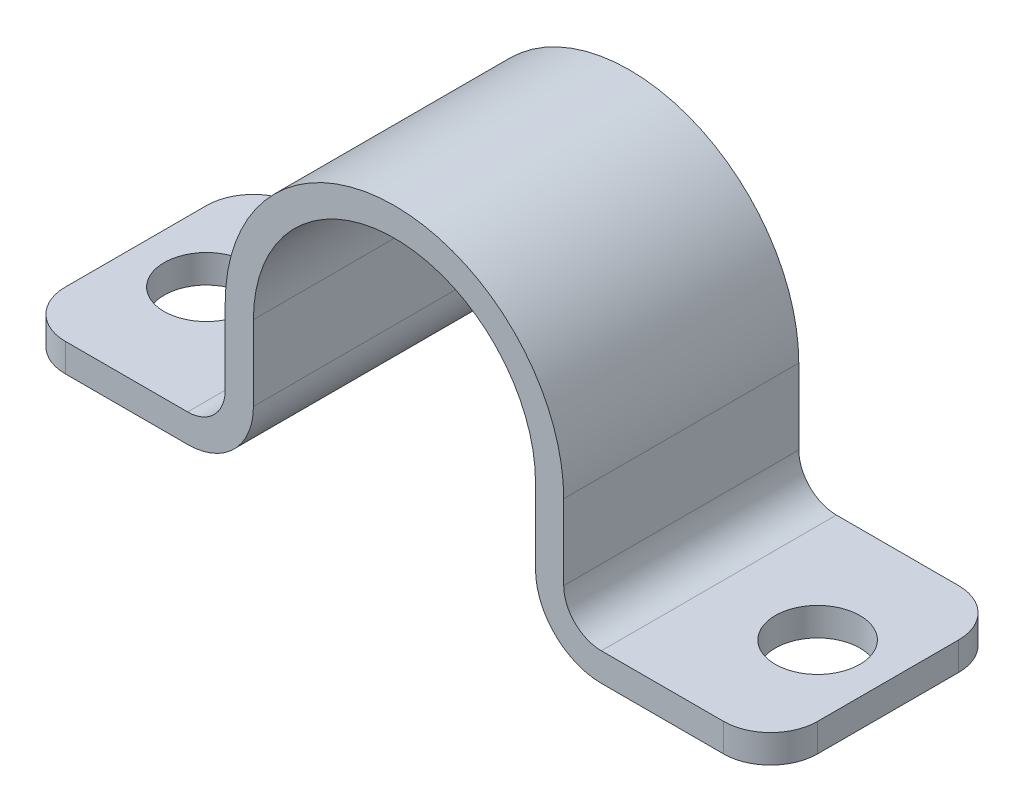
ISO-10303-21;
HEADER;
FILE_DESCRIPTION(('STEP AP214'),'2;1');
FILE_NAME('part.step','',(''),(''),'','','');
FILE_SCHEMA(('AUTOMOTIVE_DESIGN { 1 0 10303 214 1 1 1 1 }'));
ENDSEC;
DATA;
#1=APPLICATION_CONTEXT('core data for automotive mechanical design processes');
#2=APPLICATION_PROTOCOL_DEFINITION('international standard','automotive_design',2000,#1);
#3=PRODUCT_CONTEXT('',#1,'mechanical');
#4=PRODUCT('Part','Part','',(#3));
#5=PRODUCT_RELATED_PRODUCT_CATEGORY('part','',(#4));
#6=PRODUCT_DEFINITION_FORMATION('','',#4);
#7=PRODUCT_DEFINITION_CONTEXT('part definition',#1,'design');
#8=PRODUCT_DEFINITION('design','',#6,#7);
#9=PRODUCT_DEFINITION_SHAPE('','',#8);
#10=(LENGTH_UNIT() NAMED_UNIT(*) SI_UNIT(.MILLI.,.METRE.));
#11=(NAMED_UNIT(*) PLANE_ANGLE_UNIT() SI_UNIT($,.RADIAN.));
#12=(NAMED_UNIT(*) SI_UNIT($,.STERADIAN.) SOLID_ANGLE_UNIT());
#13=UNCERTAINTY_MEASURE_WITH_UNIT(LENGTH_MEASURE(1.E-05),#10,'distance_accuracy_value','');
#14=(GEOMETRIC_REPRESENTATION_CONTEXT(3) GLOBAL_UNCERTAINTY_ASSIGNED_CONTEXT((#13)) GLOBAL_UNIT_ASSIGNED_CONTEXT((#10,
#11,#12)) REPRESENTATION_CONTEXT('',''));
#15=CARTESIAN_POINT('',(0.,0.,0.));
#16=DIRECTION('',(0.,0.,1.));
#17=DIRECTION('',(1.,0.,0.));
#18=AXIS2_PLACEMENT_3D('',#15,#16,#17);
#19=CARTESIAN_POINT('',(-40.,3.,25.));
#20=DIRECTION('',(1.,0.,0.));
#21=DIRECTION('',(0.,1.,0.));
#22=AXIS2_PLACEMENT_3D('',#19,#20,#21);
#23=PLANE('',#22);
#24=DIRECTION('',(0.,0.,-1.));
#25=VECTOR('',#24,1.);
#26=CARTESIAN_POINT('',(-40.,0.,25.));
#27=LINE('',#26,#25);
#28=CARTESIAN_POINT('',(-40.,0.,20.));
#29=VERTEX_POINT('',#28);
#30=CARTESIAN_POINT('',(-40.,0.,4.99999999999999));
#31=VERTEX_POINT('',#30);
#32=EDGE_CURVE('E178',#29,#31,#27,.T.);
#33=ORIENTED_EDGE('',*,*,#32,.F.);
#34=DIRECTION('',(0.,-1.,0.));
#35=VECTOR('',#34,1.);
#36=CARTESIAN_POINT('',(-40.,3.,20.));
#37=LINE('',#36,#35);
#38=CARTESIAN_POINT('',(-40.,3.,20.));
#39=VERTEX_POINT('',#38);
#40=EDGE_CURVE('E308',#29,#39,#37,.F.);
#41=ORIENTED_EDGE('',*,*,#40,.T.);
#42=DIRECTION('',(0.,0.,-1.));
#43=VECTOR('',#42,1.);
#44=CARTESIAN_POINT('',(-40.,3.,25.));
#45=LINE('',#44,#43);
#46=CARTESIAN_POINT('',(-40.,3.,4.99999999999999));
#47=VERTEX_POINT('',#46);
#48=EDGE_CURVE('E263',#39,#47,#45,.T.);
#49=ORIENTED_EDGE('',*,*,#48,.T.);
#50=DIRECTION('',(0.,-1.,0.));
#51=VECTOR('',#50,1.);
#52=CARTESIAN_POINT('',(-40.,3.,4.99999999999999));
#53=LINE('',#52,#51);
#54=EDGE_CURVE('E305',#47,#31,#53,.T.);
#55=ORIENTED_EDGE('',*,*,#54,.T.);
#56=EDGE_LOOP('',(#33,#41,#49,#55));
#57=FACE_BOUND('',#56,.T.);
#58=ADVANCED_FACE('F30',(#57),#23,.F.);
#59=CARTESIAN_POINT('',(-22.,0.,25.));
#60=DIRECTION('',(0.,-1.,0.));
#61=DIRECTION('',(1.,0.,0.));
#62=AXIS2_PLACEMENT_3D('',#59,#60,#61);
#63=PLANE('',#62);
#64=CARTESIAN_POINT('',(-32.5,0.,12.5));
#65=DIRECTION('',(0.,-1.,0.));
#66=DIRECTION('',(1.,0.,0.));
#67=AXIS2_PLACEMENT_3D('',#64,#65,#66);
#68=CIRCLE('',#67,4.5);
#69=CARTESIAN_POINT('',(-28.,0.,12.5));
#70=VERTEX_POINT('',#69);
#71=EDGE_CURVE('E196',#70,#70,#68,.T.);
#72=ORIENTED_EDGE('',*,*,#71,.F.);
#73=EDGE_LOOP('',(#72));
#74=FACE_BOUND('',#73,.T.);
#75=DIRECTION('',(-1.,0.,0.));
#76=VECTOR('',#75,1.);
#77=CARTESIAN_POINT('',(-22.,0.,25.));
#78=LINE('',#77,#76);
#79=CARTESIAN_POINT('',(-22.,0.,25.));
#80=VERTEX_POINT('',#79);
#81=CARTESIAN_POINT('',(-35.0000000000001,0.,25.));
#82=VERTEX_POINT('',#81);
#83=EDGE_CURVE('E230',#80,#82,#78,.T.);
#84=ORIENTED_EDGE('',*,*,#83,.T.);
#85=CARTESIAN_POINT('',(-35.0000000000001,0.,20.));
#86=DIRECTION('',(0.,-1.,0.));
#87=DIRECTION('',(1.,0.,0.));
#88=AXIS2_PLACEMENT_3D('',#85,#86,#87);
#89=CIRCLE('',#88,4.99999999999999);
#90=EDGE_CURVE('E303',#82,#29,#89,.T.);
#91=ORIENTED_EDGE('',*,*,#90,.T.);
#92=ORIENTED_EDGE('',*,*,#32,.T.);
#93=CARTESIAN_POINT('',(-35.0000000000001,0.,4.99999999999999));
#94=DIRECTION('',(0.,-1.,0.));
#95=DIRECTION('',(1.,0.,0.));
#96=AXIS2_PLACEMENT_3D('',#93,#94,#95);
#97=CIRCLE('',#96,4.99999999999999);
#98=CARTESIAN_POINT('',(-35.0000000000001,0.,0.));
#99=VERTEX_POINT('',#98);
#100=EDGE_CURVE('E192',#31,#99,#97,.T.);
#101=ORIENTED_EDGE('',*,*,#100,.T.);
#102=DIRECTION('',(-1.,0.,0.));
#103=VECTOR('',#102,1.);
#104=CARTESIAN_POINT('',(-22.,0.,0.));
#105=LINE('',#104,#103);
#106=CARTESIAN_POINT('',(-22.,0.,0.));
#107=VERTEX_POINT('',#106);
#108=EDGE_CURVE('E184',#107,#99,#105,.T.);
#109=ORIENTED_EDGE('',*,*,#108,.F.);
#110=DIRECTION('',(0.,0.,-1.));
#111=VECTOR('',#110,1.);
#112=CARTESIAN_POINT('',(-22.,0.,25.));
#113=LINE('',#112,#111);
#114=EDGE_CURVE('E167',#80,#107,#113,.T.);
#115=ORIENTED_EDGE('',*,*,#114,.F.);
#116=EDGE_LOOP('',(#84,#91,#92,#101,#109,#115));
#117=FACE_BOUND('',#116,.T.);
#118=ADVANCED_FACE('F190',(#74,#117),#63,.T.);
#119=CARTESIAN_POINT('',(-22.,7.,25.));
#120=DIRECTION('',(0.,0.,-1.));
#121=DIRECTION('',(-1.,0.,0.));
#122=AXIS2_PLACEMENT_3D('',#119,#120,#121);
#123=CYLINDRICAL_SURFACE('',#122,7.);
#124=CARTESIAN_POINT('',(-22.,7.,0.));
#125=DIRECTION('',(0.,0.,1.));
#126=DIRECTION('',(1.,0.,0.));
#127=AXIS2_PLACEMENT_3D('',#124,#125,#126);
#128=CIRCLE('',#127,7.);
#129=CARTESIAN_POINT('',(-15.,7.,0.));
#130=VERTEX_POINT('',#129);
#131=EDGE_CURVE('E171',#107,#130,#128,.T.);
#132=ORIENTED_EDGE('',*,*,#131,.T.);
#133=DIRECTION('',(0.,0.,-1.));
#134=VECTOR('',#133,1.);
#135=CARTESIAN_POINT('',(-15.,7.,25.));
#136=LINE('',#135,#134);
#137=CARTESIAN_POINT('',(-15.,7.,25.));
#138=VERTEX_POINT('',#137);
#139=EDGE_CURVE('E179',#138,#130,#136,.T.);
#140=ORIENTED_EDGE('',*,*,#139,.F.);
#141=CARTESIAN_POINT('',(-22.,7.,25.));
#142=DIRECTION('',(0.,0.,1.));
#143=DIRECTION('',(1.,0.,0.));
#144=AXIS2_PLACEMENT_3D('',#141,#142,#143);
#145=CIRCLE('',#144,7.);
#146=EDGE_CURVE('E173',#80,#138,#145,.T.);
#147=ORIENTED_EDGE('',*,*,#146,.F.);
#148=ORIENTED_EDGE('',*,*,#114,.T.);
#149=EDGE_LOOP('',(#132,#140,#147,#148));
#150=FACE_BOUND('',#149,.T.);
#151=ADVANCED_FACE('F169',(#150),#123,.T.);
#152=CARTESIAN_POINT('',(-15.,15.,25.));
#153=DIRECTION('',(1.,0.,0.));
#154=DIRECTION('',(0.,1.,0.));
#155=AXIS2_PLACEMENT_3D('',#152,#153,#154);
#156=PLANE('',#155);
#157=DIRECTION('',(0.,-1.,0.));
#158=VECTOR('',#157,1.);
#159=CARTESIAN_POINT('',(-15.,15.,0.));
#160=LINE('',#159,#158);
#161=CARTESIAN_POINT('',(-15.,15.,0.));
#162=VERTEX_POINT('',#161);
#163=EDGE_CURVE('E188',#162,#130,#160,.T.);
#164=ORIENTED_EDGE('',*,*,#163,.F.);
#165=DIRECTION('',(0.,0.,-1.));
#166=VECTOR('',#165,1.);
#167=CARTESIAN_POINT('',(-15.,15.,25.));
#168=LINE('',#167,#166);
#169=CARTESIAN_POINT('',(-15.,15.,25.));
#170=VERTEX_POINT('',#169);
#171=EDGE_CURVE('E292',#170,#162,#168,.T.);
#172=ORIENTED_EDGE('',*,*,#171,.F.);
#173=DIRECTION('',(0.,-1.,0.));
#174=VECTOR('',#173,1.);
#175=CARTESIAN_POINT('',(-15.,15.,25.));
#176=LINE('',#175,#174);
#177=EDGE_CURVE('E233',#170,#138,#176,.T.);
#178=ORIENTED_EDGE('',*,*,#177,.T.);
#179=ORIENTED_EDGE('',*,*,#139,.T.);
#180=EDGE_LOOP('',(#164,#172,#178,#179));
#181=FACE_BOUND('',#180,.T.);
#182=ADVANCED_FACE('F401',(#181),#156,.T.);
#183=CARTESIAN_POINT('',(0.,15.,25.));
#184=DIRECTION('',(0.,0.,-1.));
#185=DIRECTION('',(-1.,0.,0.));
#186=AXIS2_PLACEMENT_3D('',#183,#184,#185);
#187=CYLINDRICAL_SURFACE('',#186,15.);
#188=CARTESIAN_POINT('',(0.,15.,0.));
#189=DIRECTION('',(0.,0.,1.));
#190=DIRECTION('',(1.,0.,0.));
#191=AXIS2_PLACEMENT_3D('',#188,#189,#190);
#192=CIRCLE('',#191,15.);
#193=CARTESIAN_POINT('',(15.,15.,0.));
#194=VERTEX_POINT('',#193);
#195=EDGE_CURVE('E201',#194,#162,#192,.T.);
#196=ORIENTED_EDGE('',*,*,#195,.F.);
#197=DIRECTION('',(0.,0.,-1.));
#198=VECTOR('',#197,1.);
#199=CARTESIAN_POINT('',(15.,15.,25.));
#200=LINE('',#199,#198);
#201=CARTESIAN_POINT('',(15.,15.,25.));
#202=VERTEX_POINT('',#201);
#203=EDGE_CURVE('E290',#202,#194,#200,.T.);
#204=ORIENTED_EDGE('',*,*,#203,.F.);
#205=CARTESIAN_POINT('',(0.,15.,25.));
#206=DIRECTION('',(0.,0.,1.));
#207=DIRECTION('',(1.,0.,0.));
#208=AXIS2_PLACEMENT_3D('',#205,#206,#207);
#209=CIRCLE('',#208,15.);
#210=EDGE_CURVE('E236',#202,#170,#209,.T.);
#211=ORIENTED_EDGE('',*,*,#210,.T.);
#212=ORIENTED_EDGE('',*,*,#171,.T.);
#213=EDGE_LOOP('',(#196,#204,#211,#212));
#214=FACE_BOUND('',#213,.T.);
#215=ADVANCED_FACE('F407',(#214),#187,.F.);
#216=CARTESIAN_POINT('',(15.,15.,25.));
#217=DIRECTION('',(1.,0.,0.));
#218=DIRECTION('',(0.,1.,0.));
#219=AXIS2_PLACEMENT_3D('',#216,#217,#218);
#220=PLANE('',#219);
#221=DIRECTION('',(0.,-1.,0.));
#222=VECTOR('',#221,1.);
#223=CARTESIAN_POINT('',(15.,15.,0.));
#224=LINE('',#223,#222);
#225=CARTESIAN_POINT('',(15.,7.00000000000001,0.));
#226=VERTEX_POINT('',#225);
#227=EDGE_CURVE('E203',#194,#226,#224,.T.);
#228=ORIENTED_EDGE('',*,*,#227,.T.);
#229=DIRECTION('',(0.,0.,-1.));
#230=VECTOR('',#229,1.);
#231=CARTESIAN_POINT('',(15.,7.00000000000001,25.));
#232=LINE('',#231,#230);
#233=CARTESIAN_POINT('',(15.,7.00000000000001,25.));
#234=VERTEX_POINT('',#233);
#235=EDGE_CURVE('E288',#234,#226,#232,.T.);
#236=ORIENTED_EDGE('',*,*,#235,.F.);
#237=DIRECTION('',(0.,-1.,0.));
#238=VECTOR('',#237,1.);
#239=CARTESIAN_POINT('',(15.,15.,25.));
#240=LINE('',#239,#238);
#241=EDGE_CURVE('E239',#202,#234,#240,.T.);
#242=ORIENTED_EDGE('',*,*,#241,.F.);
#243=ORIENTED_EDGE('',*,*,#203,.T.);
#244=EDGE_LOOP('',(#228,#236,#242,#243));
#245=FACE_BOUND('',#244,.T.);
#246=ADVANCED_FACE('F411',(#245),#220,.F.);
#247=CARTESIAN_POINT('',(22.,7.00000000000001,25.));
#248=DIRECTION('',(0.,0.,-1.));
#249=DIRECTION('',(-1.,0.,0.));
#250=AXIS2_PLACEMENT_3D('',#247,#248,#249);
#251=CYLINDRICAL_SURFACE('',#250,7.);
#252=CARTESIAN_POINT('',(22.,7.00000000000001,0.));
#253=DIRECTION('',(0.,0.,-1.));
#254=DIRECTION('',(-1.,0.,0.));
#255=AXIS2_PLACEMENT_3D('',#252,#253,#254);
#256=CIRCLE('',#255,7.);
#257=CARTESIAN_POINT('',(22.,0.,0.));
#258=VERTEX_POINT('',#257);
#259=EDGE_CURVE('E206',#258,#226,#256,.T.);
#260=ORIENTED_EDGE('',*,*,#259,.F.);
#261=DIRECTION('',(0.,0.,-1.));
#262=VECTOR('',#261,1.);
#263=CARTESIAN_POINT('',(22.,0.,25.));
#264=LINE('',#263,#262);
#265=CARTESIAN_POINT('',(22.,0.,25.));
#266=VERTEX_POINT('',#265);
#267=EDGE_CURVE('E285',#266,#258,#264,.T.);
#268=ORIENTED_EDGE('',*,*,#267,.F.);
#269=CARTESIAN_POINT('',(22.,7.00000000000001,25.));
#270=DIRECTION('',(0.,0.,-1.));
#271=DIRECTION('',(-1.,0.,0.));
#272=AXIS2_PLACEMENT_3D('',#269,#270,#271);
#273=CIRCLE('',#272,7.);
#274=EDGE_CURVE('E241',#266,#234,#273,.T.);
#275=ORIENTED_EDGE('',*,*,#274,.T.);
#276=ORIENTED_EDGE('',*,*,#235,.T.);
#277=EDGE_LOOP('',(#260,#268,#275,#276));
#278=FACE_BOUND('',#277,.T.);
#279=ADVANCED_FACE('F415',(#278),#251,.T.);
#280=CARTESIAN_POINT('',(40.,0.,25.));
#281=DIRECTION('',(0.,-1.,0.));
#282=DIRECTION('',(1.,0.,0.));
#283=AXIS2_PLACEMENT_3D('',#280,#281,#282);
#284=PLANE('',#283);
#285=CARTESIAN_POINT('',(32.5,0.,12.5));
#286=DIRECTION('',(0.,-1.,0.));
#287=DIRECTION('',(1.,0.,0.));
#288=AXIS2_PLACEMENT_3D('',#285,#286,#287);
#289=CIRCLE('',#288,4.5);
#290=CARTESIAN_POINT('',(37.,0.,12.5));
#291=VERTEX_POINT('',#290);
#292=EDGE_CURVE('E528',#291,#291,#289,.T.);
#293=ORIENTED_EDGE('',*,*,#292,.F.);
#294=EDGE_LOOP('',(#293));
#295=FACE_BOUND('',#294,.T.);
#296=DIRECTION('',(-1.,0.,0.));
#297=VECTOR('',#296,1.);
#298=CARTESIAN_POINT('',(40.,0.,0.));
#299=LINE('',#298,#297);
#300=CARTESIAN_POINT('',(35.,0.,0.));
#301=VERTEX_POINT('',#300);
#302=EDGE_CURVE('E209',#301,#258,#299,.T.);
#303=ORIENTED_EDGE('',*,*,#302,.F.);
#304=CARTESIAN_POINT('',(35.,0.,4.99999999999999));
#305=DIRECTION('',(0.,-1.,0.));
#306=DIRECTION('',(1.,0.,0.));
#307=AXIS2_PLACEMENT_3D('',#304,#305,#306);
#308=CIRCLE('',#307,4.99999999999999);
#309=CARTESIAN_POINT('',(40.,0.,4.99999999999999));
#310=VERTEX_POINT('',#309);
#311=EDGE_CURVE('E11',#301,#310,#308,.T.);
#312=ORIENTED_EDGE('',*,*,#311,.T.);
#313=DIRECTION('',(0.,0.,-1.));
#314=VECTOR('',#313,1.);
#315=CARTESIAN_POINT('',(40.,0.,25.));
#316=LINE('',#315,#314);
#317=CARTESIAN_POINT('',(40.,0.,20.));
#318=VERTEX_POINT('',#317);
#319=EDGE_CURVE('E283',#318,#310,#316,.T.);
#320=ORIENTED_EDGE('',*,*,#319,.F.);
#321=CARTESIAN_POINT('',(35.,0.,20.));
#322=DIRECTION('',(0.,-1.,0.));
#323=DIRECTION('',(1.,0.,0.));
#324=AXIS2_PLACEMENT_3D('',#321,#322,#323);
#325=CIRCLE('',#324,4.99999999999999);
#326=CARTESIAN_POINT('',(35.,0.,25.));
#327=VERTEX_POINT('',#326);
#328=EDGE_CURVE('E38',#318,#327,#325,.T.);
#329=ORIENTED_EDGE('',*,*,#328,.T.);
#330=DIRECTION('',(-1.,0.,0.));
#331=VECTOR('',#330,1.);
#332=CARTESIAN_POINT('',(40.,0.,25.));
#333=LINE('',#332,#331);
#334=EDGE_CURVE('E244',#327,#266,#333,.T.);
#335=ORIENTED_EDGE('',*,*,#334,.T.);
#336=ORIENTED_EDGE('',*,*,#267,.T.);
#337=EDGE_LOOP('',(#303,#312,#320,#329,#335,#336));
#338=FACE_BOUND('',#337,.T.);
#339=ADVANCED_FACE('F328',(#295,#338),#284,.T.);
#340=CARTESIAN_POINT('',(40.,0.,25.));
#341=DIRECTION('',(-1.,0.,0.));
#342=DIRECTION('',(0.,-1.,0.));
#343=AXIS2_PLACEMENT_3D('',#340,#341,#342);
#344=PLANE('',#343);
#345=ORIENTED_EDGE('',*,*,#319,.T.);
#346=DIRECTION('',(0.,1.,0.));
#347=VECTOR('',#346,1.);
#348=CARTESIAN_POINT('',(40.,0.,4.99999999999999));
#349=LINE('',#348,#347);
#350=CARTESIAN_POINT('',(40.,3.,4.99999999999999));
#351=VERTEX_POINT('',#350);
#352=EDGE_CURVE('E319',#310,#351,#349,.T.);
#353=ORIENTED_EDGE('',*,*,#352,.T.);
#354=DIRECTION('',(0.,0.,-1.));
#355=VECTOR('',#354,1.);
#356=CARTESIAN_POINT('',(40.,3.,25.));
#357=LINE('',#356,#355);
#358=CARTESIAN_POINT('',(40.,3.,20.));
#359=VERTEX_POINT('',#358);
#360=EDGE_CURVE('E280',#359,#351,#357,.T.);
#361=ORIENTED_EDGE('',*,*,#360,.F.);
#362=DIRECTION('',(0.,1.,0.));
#363=VECTOR('',#362,1.);
#364=CARTESIAN_POINT('',(40.,0.,20.));
#365=LINE('',#364,#363);
#366=EDGE_CURVE('E50',#359,#318,#365,.F.);
#367=ORIENTED_EDGE('',*,*,#366,.T.);
#368=EDGE_LOOP('',(#345,#353,#361,#367));
#369=FACE_BOUND('',#368,.T.);
#370=ADVANCED_FACE('F340',(#369),#344,.F.);
#371=CARTESIAN_POINT('',(22.,3.,25.));
#372=DIRECTION('',(0.,1.,0.));
#373=DIRECTION('',(0.,0.,1.));
#374=AXIS2_PLACEMENT_3D('',#371,#372,#373);
#375=PLANE('',#374);
#376=CARTESIAN_POINT('',(32.5,3.,12.5));
#377=DIRECTION('',(0.,1.,0.));
#378=DIRECTION('',(0.,0.,1.));
#379=AXIS2_PLACEMENT_3D('',#376,#377,#378);
#380=CIRCLE('',#379,4.5);
#381=CARTESIAN_POINT('',(32.5,3.,17.));
#382=VERTEX_POINT('',#381);
#383=EDGE_CURVE('E33',#382,#382,#380,.T.);
#384=ORIENTED_EDGE('',*,*,#383,.F.);
#385=EDGE_LOOP('',(#384));
#386=FACE_BOUND('',#385,.T.);
#387=ORIENTED_EDGE('',*,*,#360,.T.);
#388=CARTESIAN_POINT('',(35.,3.,4.99999999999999));
#389=DIRECTION('',(0.,1.,0.));
#390=DIRECTION('',(0.,0.,1.));
#391=AXIS2_PLACEMENT_3D('',#388,#389,#390);
#392=CIRCLE('',#391,4.99999999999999);
#393=CARTESIAN_POINT('',(35.,3.,0.));
#394=VERTEX_POINT('',#393);
#395=EDGE_CURVE('E324',#351,#394,#392,.T.);
#396=ORIENTED_EDGE('',*,*,#395,.T.);
#397=DIRECTION('',(1.,0.,0.));
#398=VECTOR('',#397,1.);
#399=CARTESIAN_POINT('',(22.,3.,0.));
#400=LINE('',#399,#398);
#401=CARTESIAN_POINT('',(22.,3.,0.));
#402=VERTEX_POINT('',#401);
#403=EDGE_CURVE('E211',#402,#394,#400,.T.);
#404=ORIENTED_EDGE('',*,*,#403,.F.);
#405=DIRECTION('',(0.,0.,-1.));
#406=VECTOR('',#405,1.);
#407=CARTESIAN_POINT('',(22.,3.,25.));
#408=LINE('',#407,#406);
#409=CARTESIAN_POINT('',(22.,3.,25.));
#410=VERTEX_POINT('',#409);
#411=EDGE_CURVE('E278',#410,#402,#408,.T.);
#412=ORIENTED_EDGE('',*,*,#411,.F.);
#413=DIRECTION('',(1.,0.,0.));
#414=VECTOR('',#413,1.);
#415=CARTESIAN_POINT('',(22.,3.,25.));
#416=LINE('',#415,#414);
#417=CARTESIAN_POINT('',(35.,3.,25.));
#418=VERTEX_POINT('',#417);
#419=EDGE_CURVE('E246',#410,#418,#416,.T.);
#420=ORIENTED_EDGE('',*,*,#419,.T.);
#421=CARTESIAN_POINT('',(35.,3.,20.));
#422=DIRECTION('',(0.,1.,0.));
#423=DIRECTION('',(0.,0.,1.));
#424=AXIS2_PLACEMENT_3D('',#421,#422,#423);
#425=CIRCLE('',#424,4.99999999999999);
#426=EDGE_CURVE('E322',#418,#359,#425,.T.);
#427=ORIENTED_EDGE('',*,*,#426,.T.);
#428=EDGE_LOOP('',(#387,#396,#404,#412,#420,#427));
#429=FACE_BOUND('',#428,.T.);
#430=ADVANCED_FACE('F339',(#386,#429),#375,.T.);
#431=CARTESIAN_POINT('',(22.,7.,25.));
#432=DIRECTION('',(0.,0.,-1.));
#433=DIRECTION('',(-1.,0.,0.));
#434=AXIS2_PLACEMENT_3D('',#431,#432,#433);
#435=CYLINDRICAL_SURFACE('',#434,4.);
#436=CARTESIAN_POINT('',(22.,7.,0.));
#437=DIRECTION('',(0.,0.,-1.));
#438=DIRECTION('',(-1.,0.,0.));
#439=AXIS2_PLACEMENT_3D('',#436,#437,#438);
#440=CIRCLE('',#439,4.);
#441=CARTESIAN_POINT('',(18.,7.,0.));
#442=VERTEX_POINT('',#441);
#443=EDGE_CURVE('E214',#402,#442,#440,.T.);
#444=ORIENTED_EDGE('',*,*,#443,.T.);
#445=DIRECTION('',(0.,0.,-1.));
#446=VECTOR('',#445,1.);
#447=CARTESIAN_POINT('',(18.,7.,25.));
#448=LINE('',#447,#446);
#449=CARTESIAN_POINT('',(18.,7.,25.));
#450=VERTEX_POINT('',#449);
#451=EDGE_CURVE('E276',#450,#442,#448,.T.);
#452=ORIENTED_EDGE('',*,*,#451,.F.);
#453=CARTESIAN_POINT('',(22.,7.,25.));
#454=DIRECTION('',(0.,0.,-1.));
#455=DIRECTION('',(-1.,0.,0.));
#456=AXIS2_PLACEMENT_3D('',#453,#454,#455);
#457=CIRCLE('',#456,4.);
#458=EDGE_CURVE('E249',#410,#450,#457,.T.);
#459=ORIENTED_EDGE('',*,*,#458,.F.);
#460=ORIENTED_EDGE('',*,*,#411,.T.);
#461=EDGE_LOOP('',(#444,#452,#459,#460));
#462=FACE_BOUND('',#461,.T.);
#463=ADVANCED_FACE('F351',(#462),#435,.F.);
#464=CARTESIAN_POINT('',(18.,15.,25.));
#465=DIRECTION('',(1.,0.,0.));
#466=DIRECTION('',(0.,0.,-1.));
#467=AXIS2_PLACEMENT_3D('',#464,#465,#466);
#468=PLANE('',#467);
#469=DIRECTION('',(0.,-1.,0.));
#470=VECTOR('',#469,1.);
#471=CARTESIAN_POINT('',(18.,15.,0.));
#472=LINE('',#471,#470);
#473=CARTESIAN_POINT('',(18.,15.,0.));
#474=VERTEX_POINT('',#473);
#475=EDGE_CURVE('E217',#474,#442,#472,.T.);
#476=ORIENTED_EDGE('',*,*,#475,.F.);
#477=DIRECTION('',(0.,0.,-1.));
#478=VECTOR('',#477,1.);
#479=CARTESIAN_POINT('',(18.,15.,25.));
#480=LINE('',#479,#478);
#481=CARTESIAN_POINT('',(18.,15.,25.));
#482=VERTEX_POINT('',#481);
#483=EDGE_CURVE('E274',#482,#474,#480,.T.);
#484=ORIENTED_EDGE('',*,*,#483,.F.);
#485=DIRECTION('',(0.,-1.,0.));
#486=VECTOR('',#485,1.);
#487=CARTESIAN_POINT('',(18.,15.,25.));
#488=LINE('',#487,#486);
#489=EDGE_CURVE('E251',#482,#450,#488,.T.);
#490=ORIENTED_EDGE('',*,*,#489,.T.);
#491=ORIENTED_EDGE('',*,*,#451,.T.);
#492=EDGE_LOOP('',(#476,#484,#490,#491));
#493=FACE_BOUND('',#492,.T.);
#494=ADVANCED_FACE('F357',(#493),#468,.T.);
#495=CARTESIAN_POINT('',(0.,15.,25.));
#496=DIRECTION('',(0.,0.,-1.));
#497=DIRECTION('',(-1.,0.,0.));
#498=AXIS2_PLACEMENT_3D('',#495,#496,#497);
#499=CYLINDRICAL_SURFACE('',#498,18.);
#500=CARTESIAN_POINT('',(0.,15.,0.));
#501=DIRECTION('',(0.,0.,1.));
#502=DIRECTION('',(1.,0.,0.));
#503=AXIS2_PLACEMENT_3D('',#500,#501,#502);
#504=CIRCLE('',#503,18.);
#505=CARTESIAN_POINT('',(-18.,15.,0.));
#506=VERTEX_POINT('',#505);
#507=EDGE_CURVE('E220',#474,#506,#504,.T.);
#508=ORIENTED_EDGE('',*,*,#507,.T.);
#509=DIRECTION('',(0.,0.,-1.));
#510=VECTOR('',#509,1.);
#511=CARTESIAN_POINT('',(-18.,15.,25.));
#512=LINE('',#511,#510);
#513=CARTESIAN_POINT('',(-18.,15.,25.));
#514=VERTEX_POINT('',#513);
#515=EDGE_CURVE('E271',#514,#506,#512,.T.);
#516=ORIENTED_EDGE('',*,*,#515,.F.);
#517=CARTESIAN_POINT('',(0.,15.,25.));
#518=DIRECTION('',(0.,0.,1.));
#519=DIRECTION('',(1.,0.,0.));
#520=AXIS2_PLACEMENT_3D('',#517,#518,#519);
#521=CIRCLE('',#520,18.);
#522=EDGE_CURVE('E254',#482,#514,#521,.T.);
#523=ORIENTED_EDGE('',*,*,#522,.F.);
#524=ORIENTED_EDGE('',*,*,#483,.T.);
#525=EDGE_LOOP('',(#508,#516,#523,#524));
#526=FACE_BOUND('',#525,.T.);
#527=ADVANCED_FACE('F359',(#526),#499,.T.);
#528=CARTESIAN_POINT('',(-18.,15.,25.));
#529=DIRECTION('',(1.,0.,0.));
#530=DIRECTION('',(0.,0.,-1.));
#531=AXIS2_PLACEMENT_3D('',#528,#529,#530);
#532=PLANE('',#531);
#533=DIRECTION('',(0.,-1.,0.));
#534=VECTOR('',#533,1.);
#535=CARTESIAN_POINT('',(-18.,15.,0.));
#536=LINE('',#535,#534);
#537=CARTESIAN_POINT('',(-18.,7.,0.));
#538=VERTEX_POINT('',#537);
#539=EDGE_CURVE('E222',#506,#538,#536,.T.);
#540=ORIENTED_EDGE('',*,*,#539,.T.);
#541=DIRECTION('',(0.,0.,-1.));
#542=VECTOR('',#541,1.);
#543=CARTESIAN_POINT('',(-18.,7.,25.));
#544=LINE('',#543,#542);
#545=CARTESIAN_POINT('',(-18.,7.,25.));
#546=VERTEX_POINT('',#545);
#547=EDGE_CURVE('E269',#546,#538,#544,.T.);
#548=ORIENTED_EDGE('',*,*,#547,.F.);
#549=DIRECTION('',(0.,-1.,0.));
#550=VECTOR('',#549,1.);
#551=CARTESIAN_POINT('',(-18.,15.,25.));
#552=LINE('',#551,#550);
#553=EDGE_CURVE('E256',#514,#546,#552,.T.);
#554=ORIENTED_EDGE('',*,*,#553,.F.);
#555=ORIENTED_EDGE('',*,*,#515,.T.);
#556=EDGE_LOOP('',(#540,#548,#554,#555));
#557=FACE_BOUND('',#556,.T.);
#558=ADVANCED_FACE('F364',(#557),#532,.F.);
#559=CARTESIAN_POINT('',(-22.,7.,25.));
#560=DIRECTION('',(0.,0.,-1.));
#561=DIRECTION('',(-1.,0.,0.));
#562=AXIS2_PLACEMENT_3D('',#559,#560,#561);
#563=CYLINDRICAL_SURFACE('',#562,4.);
#564=CARTESIAN_POINT('',(-22.,7.,0.));
#565=DIRECTION('',(0.,0.,1.));
#566=DIRECTION('',(1.,0.,0.));
#567=AXIS2_PLACEMENT_3D('',#564,#565,#566);
#568=CIRCLE('',#567,4.);
#569=CARTESIAN_POINT('',(-22.,3.,0.));
#570=VERTEX_POINT('',#569);
#571=EDGE_CURVE('E225',#570,#538,#568,.T.);
#572=ORIENTED_EDGE('',*,*,#571,.F.);
#573=DIRECTION('',(0.,0.,-1.));
#574=VECTOR('',#573,1.);
#575=CARTESIAN_POINT('',(-22.,3.,25.));
#576=LINE('',#575,#574);
#577=CARTESIAN_POINT('',(-22.,3.,25.));
#578=VERTEX_POINT('',#577);
#579=EDGE_CURVE('E266',#578,#570,#576,.T.);
#580=ORIENTED_EDGE('',*,*,#579,.F.);
#581=CARTESIAN_POINT('',(-22.,7.,25.));
#582=DIRECTION('',(0.,0.,1.));
#583=DIRECTION('',(1.,0.,0.));
#584=AXIS2_PLACEMENT_3D('',#581,#582,#583);
#585=CIRCLE('',#584,4.);
#586=EDGE_CURVE('E258',#578,#546,#585,.T.);
#587=ORIENTED_EDGE('',*,*,#586,.T.);
#588=ORIENTED_EDGE('',*,*,#547,.T.);
#589=EDGE_LOOP('',(#572,#580,#587,#588));
#590=FACE_BOUND('',#589,.T.);
#591=ADVANCED_FACE('F370',(#590),#563,.F.);
#592=CARTESIAN_POINT('',(-40.,3.,25.));
#593=DIRECTION('',(0.,1.,0.));
#594=DIRECTION('',(0.,0.,1.));
#595=AXIS2_PLACEMENT_3D('',#592,#593,#594);
#596=PLANE('',#595);
#597=CARTESIAN_POINT('',(-32.5,3.,12.5));
#598=DIRECTION('',(0.,1.,0.));
#599=DIRECTION('',(0.,0.,1.));
#600=AXIS2_PLACEMENT_3D('',#597,#598,#599);
#601=CIRCLE('',#600,4.5);
#602=CARTESIAN_POINT('',(-32.5,3.,17.));
#603=VERTEX_POINT('',#602);
#604=EDGE_CURVE('E193',#603,#603,#601,.T.);
#605=ORIENTED_EDGE('',*,*,#604,.F.);
#606=EDGE_LOOP('',(#605));
#607=FACE_BOUND('',#606,.T.);
#608=ORIENTED_EDGE('',*,*,#48,.F.);
#609=CARTESIAN_POINT('',(-35.,3.,20.));
#610=DIRECTION('',(0.,1.,0.));
#611=DIRECTION('',(0.,0.,1.));
#612=AXIS2_PLACEMENT_3D('',#609,#610,#611);
#613=CIRCLE('',#612,4.99999999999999);
#614=CARTESIAN_POINT('',(-35.,3.,25.));
#615=VERTEX_POINT('',#614);
#616=EDGE_CURVE('E312',#39,#615,#613,.T.);
#617=ORIENTED_EDGE('',*,*,#616,.T.);
#618=DIRECTION('',(1.,0.,0.));
#619=VECTOR('',#618,1.);
#620=CARTESIAN_POINT('',(-40.,3.,25.));
#621=LINE('',#620,#619);
#622=EDGE_CURVE('E261',#615,#578,#621,.T.);
#623=ORIENTED_EDGE('',*,*,#622,.T.);
#624=ORIENTED_EDGE('',*,*,#579,.T.);
#625=DIRECTION('',(1.,0.,0.));
#626=VECTOR('',#625,1.);
#627=CARTESIAN_POINT('',(-40.,3.,0.));
#628=LINE('',#627,#626);
#629=CARTESIAN_POINT('',(-35.,3.,0.));
#630=VERTEX_POINT('',#629);
#631=EDGE_CURVE('E228',#630,#570,#628,.T.);
#632=ORIENTED_EDGE('',*,*,#631,.F.);
#633=CARTESIAN_POINT('',(-35.,3.,4.99999999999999));
#634=DIRECTION('',(0.,1.,0.));
#635=DIRECTION('',(0.,0.,1.));
#636=AXIS2_PLACEMENT_3D('',#633,#634,#635);
#637=CIRCLE('',#636,4.99999999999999);
#638=EDGE_CURVE('E310',#630,#47,#637,.T.);
#639=ORIENTED_EDGE('',*,*,#638,.T.);
#640=EDGE_LOOP('',(#608,#617,#623,#624,#632,#639));
#641=FACE_BOUND('',#640,.T.);
#642=ADVANCED_FACE('F374',(#607,#641),#596,.T.);
#643=CARTESIAN_POINT('',(-22.,7.,25.));
#644=DIRECTION('',(0.,0.,1.));
#645=DIRECTION('',(1.,0.,0.));
#646=AXIS2_PLACEMENT_3D('',#643,#644,#645);
#647=PLANE('',#646);
#648=ORIENTED_EDGE('',*,*,#622,.F.);
#649=DIRECTION('',(0.,-1.,0.));
#650=VECTOR('',#649,1.);
#651=CARTESIAN_POINT('',(-35.0000000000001,0.,25.));
#652=LINE('',#651,#650);
#653=EDGE_CURVE('E299',#615,#82,#652,.T.);
#654=ORIENTED_EDGE('',*,*,#653,.T.);
#655=ORIENTED_EDGE('',*,*,#83,.F.);
#656=ORIENTED_EDGE('',*,*,#146,.T.);
#657=ORIENTED_EDGE('',*,*,#177,.F.);
#658=ORIENTED_EDGE('',*,*,#210,.F.);
#659=ORIENTED_EDGE('',*,*,#241,.T.);
#660=ORIENTED_EDGE('',*,*,#274,.F.);
#661=ORIENTED_EDGE('',*,*,#334,.F.);
#662=DIRECTION('',(0.,1.,0.));
#663=VECTOR('',#662,1.);
#664=CARTESIAN_POINT('',(35.,2.99999999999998,25.));
#665=LINE('',#664,#663);
#666=EDGE_CURVE('E296',#327,#418,#665,.T.);
#667=ORIENTED_EDGE('',*,*,#666,.T.);
#668=ORIENTED_EDGE('',*,*,#419,.F.);
#669=ORIENTED_EDGE('',*,*,#458,.T.);
#670=ORIENTED_EDGE('',*,*,#489,.F.);
#671=ORIENTED_EDGE('',*,*,#522,.T.);
#672=ORIENTED_EDGE('',*,*,#553,.T.);
#673=ORIENTED_EDGE('',*,*,#586,.F.);
#674=EDGE_LOOP('',(#648,#654,#655,#656,#657,#658,#659,#660,#661,#667,#668,#669,#670,#671,#672,#673));
#675=FACE_BOUND('',#674,.T.);
#676=ADVANCED_FACE('F335',(#675),#647,.T.);
#677=CARTESIAN_POINT('',(-22.,7.,0.));
#678=DIRECTION('',(0.,0.,1.));
#679=DIRECTION('',(1.,0.,0.));
#680=AXIS2_PLACEMENT_3D('',#677,#678,#679);
#681=PLANE('',#680);
#682=ORIENTED_EDGE('',*,*,#108,.T.);
#683=DIRECTION('',(0.,-1.,0.));
#684=VECTOR('',#683,1.);
#685=CARTESIAN_POINT('',(-35.,7.00000000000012,0.));
#686=LINE('',#685,#684);
#687=EDGE_CURVE('E316',#99,#630,#686,.F.);
#688=ORIENTED_EDGE('',*,*,#687,.T.);
#689=ORIENTED_EDGE('',*,*,#631,.T.);
#690=ORIENTED_EDGE('',*,*,#571,.T.);
#691=ORIENTED_EDGE('',*,*,#539,.F.);
#692=ORIENTED_EDGE('',*,*,#507,.F.);
#693=ORIENTED_EDGE('',*,*,#475,.T.);
#694=ORIENTED_EDGE('',*,*,#443,.F.);
#695=ORIENTED_EDGE('',*,*,#403,.T.);
#696=DIRECTION('',(0.,1.,0.));
#697=VECTOR('',#696,1.);
#698=CARTESIAN_POINT('',(35.,7.00000000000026,0.));
#699=LINE('',#698,#697);
#700=EDGE_CURVE('E314',#394,#301,#699,.F.);
#701=ORIENTED_EDGE('',*,*,#700,.T.);
#702=ORIENTED_EDGE('',*,*,#302,.T.);
#703=ORIENTED_EDGE('',*,*,#259,.T.);
#704=ORIENTED_EDGE('',*,*,#227,.F.);
#705=ORIENTED_EDGE('',*,*,#195,.T.);
#706=ORIENTED_EDGE('',*,*,#163,.T.);
#707=ORIENTED_EDGE('',*,*,#131,.F.);
#708=EDGE_LOOP('',(#682,#688,#689,#690,#691,#692,#693,#694,#695,#701,#702,#703,#704,#705,#706,#707));
#709=FACE_BOUND('',#708,.T.);
#710=ADVANCED_FACE('F183',(#709),#681,.F.);
#711=CARTESIAN_POINT('',(-35.,7.00000000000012,20.));
#712=DIRECTION('',(0.,1.,0.));
#713=DIRECTION('',(-1.,0.,0.));
#714=AXIS2_PLACEMENT_3D('',#711,#712,#713);
#715=CYLINDRICAL_SURFACE('',#714,4.99999999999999);
#716=ORIENTED_EDGE('',*,*,#616,.F.);
#717=ORIENTED_EDGE('',*,*,#40,.F.);
#718=ORIENTED_EDGE('',*,*,#90,.F.);
#719=ORIENTED_EDGE('',*,*,#653,.F.);
#720=EDGE_LOOP('',(#716,#717,#718,#719));
#721=FACE_BOUND('',#720,.T.);
#722=ADVANCED_FACE('F379',(#721),#715,.T.);
#723=CARTESIAN_POINT('',(-35.,2.99999999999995,4.99999999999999));
#724=DIRECTION('',(0.,-1.,0.));
#725=DIRECTION('',(1.,0.,0.));
#726=AXIS2_PLACEMENT_3D('',#723,#724,#725);
#727=CYLINDRICAL_SURFACE('',#726,4.99999999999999);
#728=ORIENTED_EDGE('',*,*,#638,.F.);
#729=ORIENTED_EDGE('',*,*,#687,.F.);
#730=ORIENTED_EDGE('',*,*,#100,.F.);
#731=ORIENTED_EDGE('',*,*,#54,.F.);
#732=EDGE_LOOP('',(#728,#729,#730,#731));
#733=FACE_BOUND('',#732,.T.);
#734=ADVANCED_FACE('F384',(#733),#727,.T.);
#735=CARTESIAN_POINT('',(35.,0.,4.99999999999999));
#736=DIRECTION('',(0.,1.,0.));
#737=DIRECTION('',(-1.,0.,0.));
#738=AXIS2_PLACEMENT_3D('',#735,#736,#737);
#739=CYLINDRICAL_SURFACE('',#738,4.99999999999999);
#740=ORIENTED_EDGE('',*,*,#311,.F.);
#741=ORIENTED_EDGE('',*,*,#700,.F.);
#742=ORIENTED_EDGE('',*,*,#395,.F.);
#743=ORIENTED_EDGE('',*,*,#352,.F.);
#744=EDGE_LOOP('',(#740,#741,#742,#743));
#745=FACE_BOUND('',#744,.T.);
#746=ADVANCED_FACE('F343',(#745),#739,.T.);
#747=CARTESIAN_POINT('',(35.,7.00000000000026,20.));
#748=DIRECTION('',(0.,-1.,0.));
#749=DIRECTION('',(1.,0.,0.));
#750=AXIS2_PLACEMENT_3D('',#747,#748,#749);
#751=CYLINDRICAL_SURFACE('',#750,4.99999999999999);
#752=ORIENTED_EDGE('',*,*,#328,.F.);
#753=ORIENTED_EDGE('',*,*,#366,.F.);
#754=ORIENTED_EDGE('',*,*,#426,.F.);
#755=ORIENTED_EDGE('',*,*,#666,.F.);
#756=EDGE_LOOP('',(#752,#753,#754,#755));
#757=FACE_BOUND('',#756,.T.);
#758=ADVANCED_FACE('F337',(#757),#751,.T.);
#759=CARTESIAN_POINT('',(-32.5,33.,12.5));
#760=DIRECTION('',(0.,-1.,0.));
#761=DIRECTION('',(1.,0.,0.));
#762=AXIS2_PLACEMENT_3D('',#759,#760,#761);
#763=CYLINDRICAL_SURFACE('',#762,4.5);
#764=ORIENTED_EDGE('',*,*,#604,.T.);
#765=EDGE_LOOP('',(#764));
#766=FACE_BOUND('',#765,.T.);
#767=ORIENTED_EDGE('',*,*,#71,.T.);
#768=EDGE_LOOP('',(#767));
#769=FACE_BOUND('',#768,.T.);
#770=ADVANCED_FACE('F470',(#766,#769),#763,.F.);
#771=CARTESIAN_POINT('',(32.5,33.,12.5));
#772=DIRECTION('',(0.,-1.,0.));
#773=DIRECTION('',(1.,0.,0.));
#774=AXIS2_PLACEMENT_3D('',#771,#772,#773);
#775=CYLINDRICAL_SURFACE('',#774,4.5);
#776=ORIENTED_EDGE('',*,*,#383,.T.);
#777=EDGE_LOOP('',(#776));
#778=FACE_BOUND('',#777,.T.);
#779=ORIENTED_EDGE('',*,*,#292,.T.);
#780=EDGE_LOOP('',(#779));
#781=FACE_BOUND('',#780,.T.);
#782=ADVANCED_FACE('F509',(#778,#781),#775,.F.);
#783=CLOSED_SHELL('',(#58,#118,#151,#182,#215,#246,#279,#339,#370,#430,#463,#494,#527,#558,#591,
#642,#676,#710,#722,#734,#746,#758,#770,#782));
#784=MANIFOLD_SOLID_BREP('B2',#783);
#785=ADVANCED_BREP_SHAPE_REPRESENTATION('',(#18,#784),#14);
#786=SHAPE_DEFINITION_REPRESENTATION(#9,#785);
ENDSEC;
END-ISO-10303-21;
